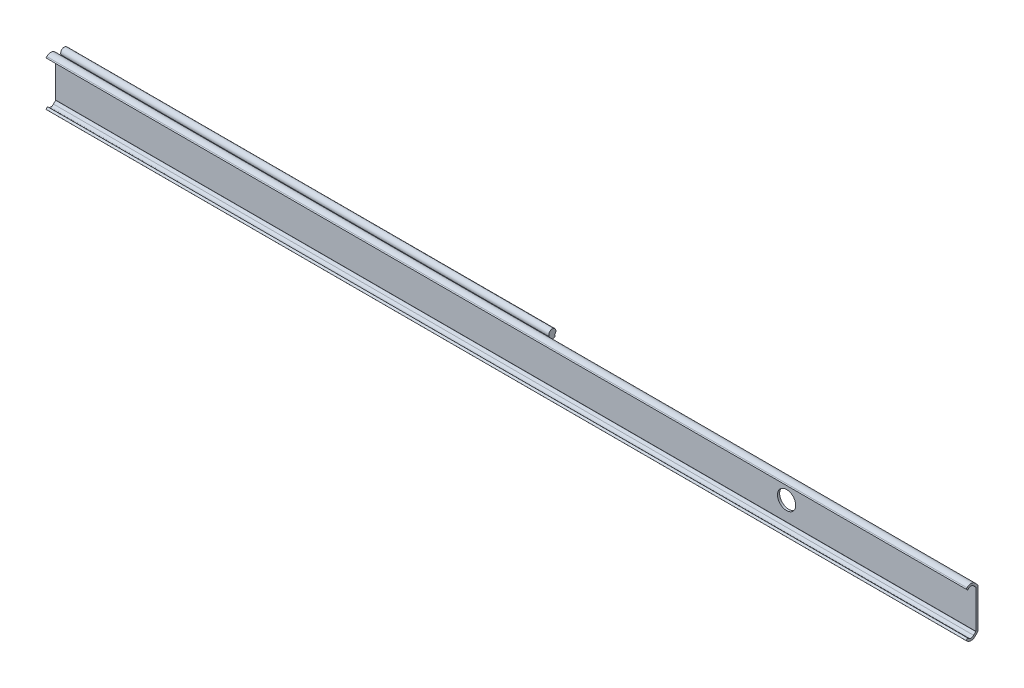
ISO-10303-21;
HEADER;
FILE_DESCRIPTION(('STEP AP214'),'2;1');
FILE_NAME('part.step','',(''),(''),'','','');
FILE_SCHEMA(('AUTOMOTIVE_DESIGN { 1 0 10303 214 1 1 1 1 }'));
ENDSEC;
DATA;
#1=APPLICATION_CONTEXT('core data for automotive mechanical design processes');
#2=APPLICATION_PROTOCOL_DEFINITION('international standard','automotive_design',2000,#1);
#3=PRODUCT_CONTEXT('',#1,'mechanical');
#4=PRODUCT('Part','Part','',(#3));
#5=PRODUCT_RELATED_PRODUCT_CATEGORY('part','',(#4));
#6=PRODUCT_DEFINITION_FORMATION('','',#4);
#7=PRODUCT_DEFINITION_CONTEXT('part definition',#1,'design');
#8=PRODUCT_DEFINITION('design','',#6,#7);
#9=PRODUCT_DEFINITION_SHAPE('','',#8);
#10=(LENGTH_UNIT() NAMED_UNIT(*) SI_UNIT(.MILLI.,.METRE.));
#11=(NAMED_UNIT(*) PLANE_ANGLE_UNIT() SI_UNIT($,.RADIAN.));
#12=(NAMED_UNIT(*) SI_UNIT($,.STERADIAN.) SOLID_ANGLE_UNIT());
#13=UNCERTAINTY_MEASURE_WITH_UNIT(LENGTH_MEASURE(1.E-05),#10,'distance_accuracy_value','');
#14=(GEOMETRIC_REPRESENTATION_CONTEXT(3) GLOBAL_UNCERTAINTY_ASSIGNED_CONTEXT((#13)) GLOBAL_UNIT_ASSIGNED_CONTEXT((#10,
#11,#12)) REPRESENTATION_CONTEXT('',''));
#15=CARTESIAN_POINT('',(0.,0.,0.));
#16=DIRECTION('',(0.,0.,1.));
#17=DIRECTION('',(1.,0.,0.));
#18=AXIS2_PLACEMENT_3D('',#15,#16,#17);
#19=CARTESIAN_POINT('',(0.,-13.561018,0.));
#20=DIRECTION('',(0.,0.,-1.));
#21=DIRECTION('',(1.,0.,0.));
#22=AXIS2_PLACEMENT_3D('',#19,#20,#21);
#23=PLANE('',#22);
#24=CARTESIAN_POINT('',(521.4,0.,0.));
#25=DIRECTION('',(0.,0.,1.));
#26=DIRECTION('',(0.,-1.,0.));
#27=AXIS2_PLACEMENT_3D('',#24,#25,#26);
#28=CIRCLE('',#27,6.5);
#29=CARTESIAN_POINT('',(521.4,-6.5,0.));
#30=VERTEX_POINT('',#29);
#31=EDGE_CURVE('E326',#30,#30,#28,.F.);
#32=ORIENTED_EDGE('',*,*,#31,.F.);
#33=EDGE_LOOP('',(#32));
#34=FACE_BOUND('',#33,.T.);
#35=DIRECTION('',(0.,1.,0.));
#36=VECTOR('',#35,1.);
#37=CARTESIAN_POINT('',(0.,-13.561018,0.));
#38=LINE('',#37,#36);
#39=CARTESIAN_POINT('',(0.,-13.561018,0.));
#40=VERTEX_POINT('',#39);
#41=CARTESIAN_POINT('',(0.,-10.7622239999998,0.));
#42=VERTEX_POINT('',#41);
#43=EDGE_CURVE('E443',#40,#42,#38,.T.);
#44=ORIENTED_EDGE('',*,*,#43,.T.);
#45=DIRECTION('',(1.,0.,0.));
#46=VECTOR('',#45,1.);
#47=CARTESIAN_POINT('',(0.,-10.7622239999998,0.));
#48=LINE('',#47,#46);
#49=CARTESIAN_POINT('',(348.2,-10.7622239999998,0.));
#50=VERTEX_POINT('',#49);
#51=EDGE_CURVE('E9',#42,#50,#48,.T.);
#52=ORIENTED_EDGE('',*,*,#51,.T.);
#53=DIRECTION('',(0.,-1.,0.));
#54=VECTOR('',#53,1.);
#55=CARTESIAN_POINT('',(348.2,10.7622239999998,0.));
#56=LINE('',#55,#54);
#57=CARTESIAN_POINT('',(348.2,10.7622239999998,0.));
#58=VERTEX_POINT('',#57);
#59=EDGE_CURVE('E324',#58,#50,#56,.T.);
#60=ORIENTED_EDGE('',*,*,#59,.F.);
#61=DIRECTION('',(1.,0.,0.));
#62=VECTOR('',#61,1.);
#63=CARTESIAN_POINT('',(0.,10.7622239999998,0.));
#64=LINE('',#63,#62);
#65=CARTESIAN_POINT('',(0.,10.7622239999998,0.));
#66=VERTEX_POINT('',#65);
#67=EDGE_CURVE('E23',#66,#58,#64,.T.);
#68=ORIENTED_EDGE('',*,*,#67,.F.);
#69=CARTESIAN_POINT('',(0.,13.561018,0.));
#70=VERTEX_POINT('',#69);
#71=EDGE_CURVE('E256',#66,#70,#38,.T.);
#72=ORIENTED_EDGE('',*,*,#71,.T.);
#73=DIRECTION('',(1.,0.,0.));
#74=VECTOR('',#73,1.);
#75=CARTESIAN_POINT('',(0.,13.561018,0.));
#76=LINE('',#75,#74);
#77=CARTESIAN_POINT('',(656.4,13.561018,0.));
#78=VERTEX_POINT('',#77);
#79=EDGE_CURVE('E456',#70,#78,#76,.T.);
#80=ORIENTED_EDGE('',*,*,#79,.T.);
#81=DIRECTION('',(0.,1.,0.));
#82=VECTOR('',#81,1.);
#83=CARTESIAN_POINT('',(656.4,-13.561018,0.));
#84=LINE('',#83,#82);
#85=CARTESIAN_POINT('',(656.4,-13.561018,0.));
#86=VERTEX_POINT('',#85);
#87=EDGE_CURVE('E384',#86,#78,#84,.T.);
#88=ORIENTED_EDGE('',*,*,#87,.F.);
#89=DIRECTION('',(1.,0.,0.));
#90=VECTOR('',#89,1.);
#91=CARTESIAN_POINT('',(0.,-13.561018,0.));
#92=LINE('',#91,#90);
#93=EDGE_CURVE('E459',#40,#86,#92,.T.);
#94=ORIENTED_EDGE('',*,*,#93,.F.);
#95=EDGE_LOOP('',(#44,#52,#60,#68,#72,#80,#88,#94));
#96=FACE_BOUND('',#95,.T.);
#97=ADVANCED_FACE('F14',(#34,#96),#23,.T.);
#98=CARTESIAN_POINT('',(0.,-11.8784795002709,-5.98462837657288));
#99=DIRECTION('',(0.,-0.60181512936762,-0.798635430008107));
#100=DIRECTION('',(0.,0.798635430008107,-0.60181512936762));
#101=AXIS2_PLACEMENT_3D('',#98,#99,#100);
#102=PLANE('',#101);
#103=DIRECTION('',(0.,0.798635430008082,-0.601815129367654));
#104=VECTOR('',#103,1.);
#105=CARTESIAN_POINT('',(348.2,-11.8784795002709,-5.98462837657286));
#106=LINE('',#105,#104);
#107=CARTESIAN_POINT('',(348.2,-11.6159967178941,-6.18242339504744));
#108=VERTEX_POINT('',#107);
#109=CARTESIAN_POINT('',(348.2,-11.0618539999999,-6.6));
#110=VERTEX_POINT('',#109);
#111=EDGE_CURVE('E304',#108,#110,#106,.T.);
#112=ORIENTED_EDGE('',*,*,#111,.F.);
#113=DIRECTION('',(1.,0.,0.));
#114=VECTOR('',#113,1.);
#115=CARTESIAN_POINT('',(0.,-11.6159967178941,-6.18242339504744));
#116=LINE('',#115,#114);
#117=CARTESIAN_POINT('',(0.,-11.6159967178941,-6.18242339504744));
#118=VERTEX_POINT('',#117);
#119=EDGE_CURVE('E299',#118,#108,#116,.T.);
#120=ORIENTED_EDGE('',*,*,#119,.F.);
#121=DIRECTION('',(0.,0.798635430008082,-0.601815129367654));
#122=VECTOR('',#121,1.);
#123=CARTESIAN_POINT('',(0.,-11.6159967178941,-6.18242339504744));
#124=LINE('',#123,#122);
#125=CARTESIAN_POINT('',(0.,-11.0618539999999,-6.6));
#126=VERTEX_POINT('',#125);
#127=EDGE_CURVE('E271',#118,#126,#124,.T.);
#128=ORIENTED_EDGE('',*,*,#127,.T.);
#129=DIRECTION('',(1.,0.,0.));
#130=VECTOR('',#129,1.);
#131=CARTESIAN_POINT('',(0.,-11.0618539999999,-6.6));
#132=LINE('',#131,#130);
#133=EDGE_CURVE('E18',#126,#110,#132,.T.);
#134=ORIENTED_EDGE('',*,*,#133,.T.);
#135=EDGE_LOOP('',(#112,#120,#128,#134));
#136=FACE_BOUND('',#135,.T.);
#137=ADVANCED_FACE('F16',(#136),#102,.T.);
#138=CARTESIAN_POINT('',(0.,-11.0618539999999,-6.6));
#139=DIRECTION('',(0.,0.,-1.));
#140=DIRECTION('',(1.,0.,0.));
#141=AXIS2_PLACEMENT_3D('',#138,#139,#140);
#142=PLANE('',#141);
#143=DIRECTION('',(1.,0.,0.));
#144=VECTOR('',#143,1.);
#145=CARTESIAN_POINT('',(0.,-10.4239399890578,-6.6));
#146=LINE('',#145,#144);
#147=CARTESIAN_POINT('',(0.,-10.4239399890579,-6.6));
#148=VERTEX_POINT('',#147);
#149=CARTESIAN_POINT('',(348.2,-10.4239399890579,-6.6));
#150=VERTEX_POINT('',#149);
#151=EDGE_CURVE('E509',#148,#150,#146,.T.);
#152=ORIENTED_EDGE('',*,*,#151,.T.);
#153=DIRECTION('',(0.,1.,0.));
#154=VECTOR('',#153,1.);
#155=CARTESIAN_POINT('',(348.2,-11.0618539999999,-6.6));
#156=LINE('',#155,#154);
#157=EDGE_CURVE('E306',#110,#150,#156,.T.);
#158=ORIENTED_EDGE('',*,*,#157,.F.);
#159=ORIENTED_EDGE('',*,*,#133,.F.);
#160=DIRECTION('',(0.,1.,0.));
#161=VECTOR('',#160,1.);
#162=CARTESIAN_POINT('',(0.,-11.0618539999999,-6.6));
#163=LINE('',#162,#161);
#164=EDGE_CURVE('E274',#126,#148,#163,.T.);
#165=ORIENTED_EDGE('',*,*,#164,.T.);
#166=EDGE_LOOP('',(#152,#158,#159,#165));
#167=FACE_BOUND('',#166,.T.);
#168=ADVANCED_FACE('F518',(#167),#142,.T.);
#169=CARTESIAN_POINT('',(0.,-13.915,-4.44999999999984));
#170=DIRECTION('',(1.,0.,0.));
#171=DIRECTION('',(0.,0.,1.));
#172=AXIS2_PLACEMENT_3D('',#169,#170,#171);
#173=CYLINDRICAL_SURFACE('',#172,4.1);
#174=DIRECTION('',(1.,0.,0.));
#175=VECTOR('',#174,1.);
#176=CARTESIAN_POINT('',(0.,-10.8444026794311,-1.73312089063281));
#177=LINE('',#176,#175);
#178=CARTESIAN_POINT('',(0.,-10.8444026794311,-1.73312089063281));
#179=VERTEX_POINT('',#178);
#180=CARTESIAN_POINT('',(348.2,-10.8444026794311,-1.73312089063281));
#181=VERTEX_POINT('',#180);
#182=EDGE_CURVE('E507',#179,#181,#177,.T.);
#183=ORIENTED_EDGE('',*,*,#182,.T.);
#184=CARTESIAN_POINT('',(348.2,-13.915,-4.44999999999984));
#185=DIRECTION('',(1.,0.,0.));
#186=DIRECTION('',(0.,0.,1.));
#187=AXIS2_PLACEMENT_3D('',#184,#185,#186);
#188=CIRCLE('',#187,4.1);
#189=EDGE_CURVE('E308',#150,#181,#188,.T.);
#190=ORIENTED_EDGE('',*,*,#189,.F.);
#191=ORIENTED_EDGE('',*,*,#151,.F.);
#192=CARTESIAN_POINT('',(0.,-13.915,-4.44999999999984));
#193=DIRECTION('',(1.,0.,0.));
#194=DIRECTION('',(0.,0.,1.));
#195=AXIS2_PLACEMENT_3D('',#192,#193,#194);
#196=CIRCLE('',#195,4.1);
#197=EDGE_CURVE('E277',#148,#179,#196,.T.);
#198=ORIENTED_EDGE('',*,*,#197,.T.);
#199=EDGE_LOOP('',(#183,#190,#191,#198));
#200=FACE_BOUND('',#199,.T.);
#201=ADVANCED_FACE('F524',(#200),#173,.T.);
#202=CARTESIAN_POINT('',(0.,-10.7622239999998,-1.66));
#203=DIRECTION('',(1.,0.,0.));
#204=DIRECTION('',(0.,0.,1.));
#205=AXIS2_PLACEMENT_3D('',#202,#203,#204);
#206=CYLINDRICAL_SURFACE('',#205,0.110000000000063);
#207=DIRECTION('',(1.,0.,0.));
#208=VECTOR('',#207,1.);
#209=CARTESIAN_POINT('',(0.,-10.7622239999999,-1.54999999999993));
#210=LINE('',#209,#208);
#211=CARTESIAN_POINT('',(0.,-10.7622239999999,-1.54999999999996));
#212=VERTEX_POINT('',#211);
#213=CARTESIAN_POINT('',(348.2,-10.7622239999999,-1.54999999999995));
#214=VERTEX_POINT('',#213);
#215=EDGE_CURVE('E504',#212,#214,#210,.T.);
#216=ORIENTED_EDGE('',*,*,#215,.T.);
#217=CARTESIAN_POINT('',(348.2,-10.7622239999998,-1.66));
#218=DIRECTION('',(-1.,0.,0.));
#219=DIRECTION('',(0.,0.,1.));
#220=AXIS2_PLACEMENT_3D('',#217,#218,#219);
#221=CIRCLE('',#220,0.110000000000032);
#222=EDGE_CURVE('E310',#181,#214,#221,.T.);
#223=ORIENTED_EDGE('',*,*,#222,.F.);
#224=ORIENTED_EDGE('',*,*,#182,.F.);
#225=CARTESIAN_POINT('',(0.,-10.7622239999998,-1.66));
#226=DIRECTION('',(-1.,0.,0.));
#227=DIRECTION('',(0.,0.,1.));
#228=AXIS2_PLACEMENT_3D('',#225,#226,#227);
#229=CIRCLE('',#228,0.110000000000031);
#230=EDGE_CURVE('E280',#179,#212,#229,.T.);
#231=ORIENTED_EDGE('',*,*,#230,.T.);
#232=EDGE_LOOP('',(#216,#223,#224,#231));
#233=FACE_BOUND('',#232,.T.);
#234=ADVANCED_FACE('F531',(#233),#206,.F.);
#235=CARTESIAN_POINT('',(0.,10.7622239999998,-1.66));
#236=DIRECTION('',(1.,0.,0.));
#237=DIRECTION('',(0.,0.,1.));
#238=AXIS2_PLACEMENT_3D('',#235,#236,#237);
#239=CYLINDRICAL_SURFACE('',#238,0.110000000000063);
#240=DIRECTION('',(1.,0.,0.));
#241=VECTOR('',#240,1.);
#242=CARTESIAN_POINT('',(0.,10.8444026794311,-1.73312089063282));
#243=LINE('',#242,#241);
#244=CARTESIAN_POINT('',(0.,10.8444026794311,-1.73312089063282));
#245=VERTEX_POINT('',#244);
#246=CARTESIAN_POINT('',(348.2,10.8444026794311,-1.73312089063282));
#247=VERTEX_POINT('',#246);
#248=EDGE_CURVE('E498',#245,#247,#243,.T.);
#249=ORIENTED_EDGE('',*,*,#248,.T.);
#250=CARTESIAN_POINT('',(348.2,10.7622239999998,-1.66));
#251=DIRECTION('',(-1.,0.,0.));
#252=DIRECTION('',(0.,0.,1.));
#253=AXIS2_PLACEMENT_3D('',#250,#251,#252);
#254=CIRCLE('',#253,0.110000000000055);
#255=CARTESIAN_POINT('',(348.2,10.7622239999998,-1.54999999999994));
#256=VERTEX_POINT('',#255);
#257=EDGE_CURVE('E314',#256,#247,#254,.T.);
#258=ORIENTED_EDGE('',*,*,#257,.F.);
#259=DIRECTION('',(1.,0.,0.));
#260=VECTOR('',#259,1.);
#261=CARTESIAN_POINT('',(0.,10.7622239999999,-1.54999999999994));
#262=LINE('',#261,#260);
#263=CARTESIAN_POINT('',(0.,10.7622239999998,-1.54999999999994));
#264=VERTEX_POINT('',#263);
#265=EDGE_CURVE('E501',#264,#256,#262,.T.);
#266=ORIENTED_EDGE('',*,*,#265,.F.);
#267=CARTESIAN_POINT('',(0.,10.7622239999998,-1.66));
#268=DIRECTION('',(-1.,0.,0.));
#269=DIRECTION('',(0.,0.,1.));
#270=AXIS2_PLACEMENT_3D('',#267,#268,#269);
#271=CIRCLE('',#270,0.110000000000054);
#272=EDGE_CURVE('E286',#264,#245,#271,.T.);
#273=ORIENTED_EDGE('',*,*,#272,.T.);
#274=EDGE_LOOP('',(#249,#258,#266,#273));
#275=FACE_BOUND('',#274,.T.);
#276=ADVANCED_FACE('F538',(#275),#239,.F.);
#277=CARTESIAN_POINT('',(0.,13.915,-4.44999999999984));
#278=DIRECTION('',(1.,0.,0.));
#279=DIRECTION('',(0.,0.,1.));
#280=AXIS2_PLACEMENT_3D('',#277,#278,#279);
#281=CYLINDRICAL_SURFACE('',#280,4.1);
#282=DIRECTION('',(1.,0.,0.));
#283=VECTOR('',#282,1.);
#284=CARTESIAN_POINT('',(0.,10.4239399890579,-6.59999999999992));
#285=LINE('',#284,#283);
#286=CARTESIAN_POINT('',(0.,10.4239399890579,-6.59999999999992));
#287=VERTEX_POINT('',#286);
#288=CARTESIAN_POINT('',(348.2,10.4239399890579,-6.59999999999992));
#289=VERTEX_POINT('',#288);
#290=EDGE_CURVE('E495',#287,#289,#285,.T.);
#291=ORIENTED_EDGE('',*,*,#290,.T.);
#292=CARTESIAN_POINT('',(348.2,13.915,-4.44999999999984));
#293=DIRECTION('',(1.,0.,0.));
#294=DIRECTION('',(0.,0.,1.));
#295=AXIS2_PLACEMENT_3D('',#292,#293,#294);
#296=CIRCLE('',#295,4.09999999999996);
#297=EDGE_CURVE('E316',#247,#289,#296,.T.);
#298=ORIENTED_EDGE('',*,*,#297,.F.);
#299=ORIENTED_EDGE('',*,*,#248,.F.);
#300=CARTESIAN_POINT('',(0.,13.915,-4.44999999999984));
#301=DIRECTION('',(1.,0.,0.));
#302=DIRECTION('',(0.,0.,1.));
#303=AXIS2_PLACEMENT_3D('',#300,#301,#302);
#304=CIRCLE('',#303,4.1);
#305=EDGE_CURVE('E289',#245,#287,#304,.T.);
#306=ORIENTED_EDGE('',*,*,#305,.T.);
#307=EDGE_LOOP('',(#291,#298,#299,#306));
#308=FACE_BOUND('',#307,.T.);
#309=ADVANCED_FACE('F543',(#308),#281,.T.);
#310=CARTESIAN_POINT('',(0.,11.0618539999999,-6.6));
#311=DIRECTION('',(0.,0.,-1.));
#312=DIRECTION('',(1.,0.,0.));
#313=AXIS2_PLACEMENT_3D('',#310,#311,#312);
#314=PLANE('',#313);
#315=DIRECTION('',(1.,0.,0.));
#316=VECTOR('',#315,1.);
#317=CARTESIAN_POINT('',(0.,11.0618539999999,-6.6));
#318=LINE('',#317,#316);
#319=CARTESIAN_POINT('',(0.,11.0618539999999,-6.6));
#320=VERTEX_POINT('',#319);
#321=CARTESIAN_POINT('',(348.2,11.0618539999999,-6.6));
#322=VERTEX_POINT('',#321);
#323=EDGE_CURVE('E336',#320,#322,#318,.T.);
#324=ORIENTED_EDGE('',*,*,#323,.T.);
#325=DIRECTION('',(0.,1.,-1.2645065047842E-13));
#326=VECTOR('',#325,1.);
#327=CARTESIAN_POINT('',(348.2,10.4239399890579,-6.59999999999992));
#328=LINE('',#327,#326);
#329=EDGE_CURVE('E318',#289,#322,#328,.T.);
#330=ORIENTED_EDGE('',*,*,#329,.F.);
#331=ORIENTED_EDGE('',*,*,#290,.F.);
#332=DIRECTION('',(0.,1.,-1.2645065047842E-13));
#333=VECTOR('',#332,1.);
#334=CARTESIAN_POINT('',(0.,10.4239399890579,-6.59999999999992));
#335=LINE('',#334,#333);
#336=EDGE_CURVE('E292',#287,#320,#335,.T.);
#337=ORIENTED_EDGE('',*,*,#336,.T.);
#338=EDGE_LOOP('',(#324,#330,#331,#337));
#339=FACE_BOUND('',#338,.T.);
#340=ADVANCED_FACE('F545',(#339),#314,.T.);
#341=CARTESIAN_POINT('',(0.,11.8784795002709,-5.98462837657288));
#342=DIRECTION('',(0.,0.60181512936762,-0.798635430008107));
#343=DIRECTION('',(0.,0.798635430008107,0.60181512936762));
#344=AXIS2_PLACEMENT_3D('',#341,#342,#343);
#345=PLANE('',#344);
#346=DIRECTION('',(1.,0.,0.));
#347=VECTOR('',#346,1.);
#348=CARTESIAN_POINT('',(0.,11.6159967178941,-6.18242339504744));
#349=LINE('',#348,#347);
#350=CARTESIAN_POINT('',(0.,11.6159967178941,-6.18242339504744));
#351=VERTEX_POINT('',#350);
#352=CARTESIAN_POINT('',(348.2,11.6159967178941,-6.18242339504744));
#353=VERTEX_POINT('',#352);
#354=EDGE_CURVE('E260',#351,#353,#349,.T.);
#355=ORIENTED_EDGE('',*,*,#354,.T.);
#356=DIRECTION('',(0.,0.798635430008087,0.601815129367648));
#357=VECTOR('',#356,1.);
#358=CARTESIAN_POINT('',(348.2,11.0618539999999,-6.6));
#359=LINE('',#358,#357);
#360=EDGE_CURVE('E320',#322,#353,#359,.T.);
#361=ORIENTED_EDGE('',*,*,#360,.F.);
#362=ORIENTED_EDGE('',*,*,#323,.F.);
#363=DIRECTION('',(0.,0.798635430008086,0.601815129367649));
#364=VECTOR('',#363,1.);
#365=CARTESIAN_POINT('',(0.,11.0618539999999,-6.6));
#366=LINE('',#365,#364);
#367=EDGE_CURVE('E247',#320,#351,#366,.T.);
#368=ORIENTED_EDGE('',*,*,#367,.T.);
#369=EDGE_LOOP('',(#355,#361,#362,#368));
#370=FACE_BOUND('',#369,.T.);
#371=ADVANCED_FACE('F547',(#370),#345,.T.);
#372=CARTESIAN_POINT('',(0.,10.7622239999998,-1.66));
#373=DIRECTION('',(1.,0.,0.));
#374=DIRECTION('',(0.,0.,1.));
#375=AXIS2_PLACEMENT_3D('',#372,#373,#374);
#376=CYLINDRICAL_SURFACE('',#375,1.66);
#377=CARTESIAN_POINT('',(348.2,10.7622239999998,-1.66));
#378=DIRECTION('',(1.,0.,0.));
#379=DIRECTION('',(0.,0.,1.));
#380=AXIS2_PLACEMENT_3D('',#377,#378,#379);
#381=CIRCLE('',#380,1.65999999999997);
#382=CARTESIAN_POINT('',(348.2,12.2669175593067,-2.36106867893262));
#383=VERTEX_POINT('',#382);
#384=EDGE_CURVE('E241',#383,#58,#381,.T.);
#385=ORIENTED_EDGE('',*,*,#384,.F.);
#386=DIRECTION('',(1.,0.,0.));
#387=VECTOR('',#386,1.);
#388=CARTESIAN_POINT('',(0.,12.2669175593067,-2.36106867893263));
#389=LINE('',#388,#387);
#390=CARTESIAN_POINT('',(0.,12.2669175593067,-2.36106867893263));
#391=VERTEX_POINT('',#390);
#392=EDGE_CURVE('E237',#391,#383,#389,.T.);
#393=ORIENTED_EDGE('',*,*,#392,.F.);
#394=CARTESIAN_POINT('',(0.,10.7622239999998,-1.66));
#395=DIRECTION('',(1.,0.,0.));
#396=DIRECTION('',(0.,0.,1.));
#397=AXIS2_PLACEMENT_3D('',#394,#395,#396);
#398=CIRCLE('',#397,1.65999999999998);
#399=EDGE_CURVE('E240',#391,#66,#398,.T.);
#400=ORIENTED_EDGE('',*,*,#399,.T.);
#401=ORIENTED_EDGE('',*,*,#67,.T.);
#402=EDGE_LOOP('',(#385,#393,#400,#401));
#403=FACE_BOUND('',#402,.T.);
#404=ADVANCED_FACE('F239',(#403),#376,.T.);
#405=CARTESIAN_POINT('',(0.,-10.7622239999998,-1.66));
#406=DIRECTION('',(1.,0.,0.));
#407=DIRECTION('',(0.,0.,1.));
#408=AXIS2_PLACEMENT_3D('',#405,#406,#407);
#409=CYLINDRICAL_SURFACE('',#408,1.66);
#410=DIRECTION('',(1.,0.,0.));
#411=VECTOR('',#410,1.);
#412=CARTESIAN_POINT('',(0.,-12.2669175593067,-2.36106867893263));
#413=LINE('',#412,#411);
#414=CARTESIAN_POINT('',(0.,-12.2669175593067,-2.36106867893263));
#415=VERTEX_POINT('',#414);
#416=CARTESIAN_POINT('',(348.2,-12.2669175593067,-2.36106867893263));
#417=VERTEX_POINT('',#416);
#418=EDGE_CURVE('E246',#415,#417,#413,.T.);
#419=ORIENTED_EDGE('',*,*,#418,.T.);
#420=CARTESIAN_POINT('',(348.2,-10.7622239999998,-1.66));
#421=DIRECTION('',(1.,0.,0.));
#422=DIRECTION('',(0.,0.,1.));
#423=AXIS2_PLACEMENT_3D('',#420,#421,#422);
#424=CIRCLE('',#423,1.66);
#425=EDGE_CURVE('E298',#50,#417,#424,.T.);
#426=ORIENTED_EDGE('',*,*,#425,.F.);
#427=ORIENTED_EDGE('',*,*,#51,.F.);
#428=CARTESIAN_POINT('',(0.,-10.7622239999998,-1.66));
#429=DIRECTION('',(1.,0.,0.));
#430=DIRECTION('',(0.,0.,1.));
#431=AXIS2_PLACEMENT_3D('',#428,#429,#430);
#432=CIRCLE('',#431,1.65999999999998);
#433=EDGE_CURVE('E257',#42,#415,#432,.T.);
#434=ORIENTED_EDGE('',*,*,#433,.T.);
#435=EDGE_LOOP('',(#419,#426,#427,#434));
#436=FACE_BOUND('',#435,.T.);
#437=ADVANCED_FACE('F553',(#436),#409,.T.);
#438=CARTESIAN_POINT('',(0.,-10.7622239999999,-1.54999999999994));
#439=DIRECTION('',(0.,0.,-1.));
#440=DIRECTION('',(1.,0.,0.));
#441=AXIS2_PLACEMENT_3D('',#438,#439,#440);
#442=PLANE('',#441);
#443=ORIENTED_EDGE('',*,*,#265,.T.);
#444=DIRECTION('',(0.,1.,0.));
#445=VECTOR('',#444,1.);
#446=CARTESIAN_POINT('',(348.2,-10.7622239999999,-1.54999999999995));
#447=LINE('',#446,#445);
#448=EDGE_CURVE('E312',#214,#256,#447,.T.);
#449=ORIENTED_EDGE('',*,*,#448,.F.);
#450=ORIENTED_EDGE('',*,*,#215,.F.);
#451=DIRECTION('',(0.,1.,0.));
#452=VECTOR('',#451,1.);
#453=CARTESIAN_POINT('',(0.,-10.7622239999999,-1.54999999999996));
#454=LINE('',#453,#452);
#455=EDGE_CURVE('E283',#212,#264,#454,.T.);
#456=ORIENTED_EDGE('',*,*,#455,.T.);
#457=EDGE_LOOP('',(#443,#449,#450,#456));
#458=FACE_BOUND('',#457,.T.);
#459=ADVANCED_FACE('F533',(#458),#442,.T.);
#460=CARTESIAN_POINT('',(0.,14.8073560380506,0.501292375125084));
#461=DIRECTION('',(0.,0.692409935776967,-0.721504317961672));
#462=DIRECTION('',(0.,0.721504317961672,0.692409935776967));
#463=AXIS2_PLACEMENT_3D('',#460,#461,#462);
#464=PLANE('',#463);
#465=DIRECTION('',(0.,0.721504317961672,0.692409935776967));
#466=VECTOR('',#465,1.);
#467=CARTESIAN_POINT('',(656.4,14.8073560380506,0.501292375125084));
#468=LINE('',#467,#466);
#469=CARTESIAN_POINT('',(656.4,14.8073560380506,0.501292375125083));
#470=VERTEX_POINT('',#469);
#471=CARTESIAN_POINT('',(656.4,16.4741282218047,2.10085261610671));
#472=VERTEX_POINT('',#471);
#473=EDGE_CURVE('E389',#470,#472,#468,.T.);
#474=ORIENTED_EDGE('',*,*,#473,.F.);
#475=DIRECTION('',(1.,0.,0.));
#476=VECTOR('',#475,1.);
#477=CARTESIAN_POINT('',(0.,14.8073560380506,0.501292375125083));
#478=LINE('',#477,#476);
#479=CARTESIAN_POINT('',(0.,14.8073560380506,0.501292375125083));
#480=VERTEX_POINT('',#479);
#481=EDGE_CURVE('E454',#480,#470,#478,.T.);
#482=ORIENTED_EDGE('',*,*,#481,.F.);
#483=DIRECTION('',(0.,0.721504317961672,0.692409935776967));
#484=VECTOR('',#483,1.);
#485=CARTESIAN_POINT('',(0.,14.8073560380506,0.501292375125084));
#486=LINE('',#485,#484);
#487=CARTESIAN_POINT('',(0.,16.4741282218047,2.10085261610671));
#488=VERTEX_POINT('',#487);
#489=EDGE_CURVE('E448',#480,#488,#486,.T.);
#490=ORIENTED_EDGE('',*,*,#489,.T.);
#491=DIRECTION('',(1.,0.,0.));
#492=VECTOR('',#491,1.);
#493=CARTESIAN_POINT('',(0.,16.4741282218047,2.10085261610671));
#494=LINE('',#493,#492);
#495=EDGE_CURVE('E452',#488,#472,#494,.T.);
#496=ORIENTED_EDGE('',*,*,#495,.T.);
#497=EDGE_LOOP('',(#474,#482,#490,#496));
#498=FACE_BOUND('',#497,.T.);
#499=ADVANCED_FACE('F645',(#498),#464,.T.);
#500=CARTESIAN_POINT('',(0.,13.5750000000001,5.00000000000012));
#501=DIRECTION('',(1.,0.,0.));
#502=DIRECTION('',(0.,0.,1.));
#503=AXIS2_PLACEMENT_3D('',#500,#501,#502);
#504=CYLINDRICAL_SURFACE('',#503,4.1);
#505=CARTESIAN_POINT('',(656.4,13.5750000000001,5.00000000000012));
#506=DIRECTION('',(1.,0.,0.));
#507=DIRECTION('',(0.,0.,-1.));
#508=AXIS2_PLACEMENT_3D('',#505,#506,#507);
#509=CIRCLE('',#508,4.1);
#510=CARTESIAN_POINT('',(656.4,16.4741282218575,7.89914738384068));
#511=VERTEX_POINT('',#510);
#512=EDGE_CURVE('E332',#472,#511,#509,.T.);
#513=ORIENTED_EDGE('',*,*,#512,.F.);
#514=ORIENTED_EDGE('',*,*,#495,.F.);
#515=CARTESIAN_POINT('',(0.,13.5750000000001,5.00000000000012));
#516=DIRECTION('',(1.,0.,0.));
#517=DIRECTION('',(0.,0.,-1.));
#518=AXIS2_PLACEMENT_3D('',#515,#516,#517);
#519=CIRCLE('',#518,4.1);
#520=CARTESIAN_POINT('',(0.,16.4741282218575,7.89914738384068));
#521=VERTEX_POINT('',#520);
#522=EDGE_CURVE('E392',#488,#521,#519,.T.);
#523=ORIENTED_EDGE('',*,*,#522,.T.);
#524=DIRECTION('',(1.,0.,0.));
#525=VECTOR('',#524,1.);
#526=CARTESIAN_POINT('',(0.,16.4741282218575,7.89914738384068));
#527=LINE('',#526,#525);
#528=EDGE_CURVE('E451',#521,#511,#527,.T.);
#529=ORIENTED_EDGE('',*,*,#528,.T.);
#530=EDGE_LOOP('',(#513,#514,#523,#529));
#531=FACE_BOUND('',#530,.T.);
#532=ADVANCED_FACE('F641',(#531),#504,.T.);
#533=CARTESIAN_POINT('',(0.,15.8897090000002,8.45999999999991));
#534=DIRECTION('',(0.,0.692409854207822,0.721504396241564));
#535=DIRECTION('',(0.,-0.721504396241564,0.692409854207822));
#536=AXIS2_PLACEMENT_3D('',#533,#534,#535);
#537=PLANE('',#536);
#538=DIRECTION('',(0.,-0.721504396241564,0.692409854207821));
#539=VECTOR('',#538,1.);
#540=CARTESIAN_POINT('',(656.4,15.8897090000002,8.45999999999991));
#541=LINE('',#540,#539);
#542=CARTESIAN_POINT('',(656.4,15.8897090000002,8.45999999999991));
#543=VERTEX_POINT('',#542);
#544=EDGE_CURVE('E335',#511,#543,#541,.T.);
#545=ORIENTED_EDGE('',*,*,#544,.F.);
#546=ORIENTED_EDGE('',*,*,#528,.F.);
#547=DIRECTION('',(0.,-0.721504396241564,0.692409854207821));
#548=VECTOR('',#547,1.);
#549=CARTESIAN_POINT('',(0.,15.8897090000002,8.45999999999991));
#550=LINE('',#549,#548);
#551=CARTESIAN_POINT('',(0.,15.8897090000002,8.45999999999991));
#552=VERTEX_POINT('',#551);
#553=EDGE_CURVE('E395',#521,#552,#550,.T.);
#554=ORIENTED_EDGE('',*,*,#553,.T.);
#555=DIRECTION('',(1.,0.,0.));
#556=VECTOR('',#555,1.);
#557=CARTESIAN_POINT('',(0.,15.8897090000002,8.45999999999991));
#558=LINE('',#557,#556);
#559=EDGE_CURVE('E489',#552,#543,#558,.T.);
#560=ORIENTED_EDGE('',*,*,#559,.T.);
#561=EDGE_LOOP('',(#545,#546,#554,#560));
#562=FACE_BOUND('',#561,.T.);
#563=ADVANCED_FACE('F637',(#562),#537,.T.);
#564=CARTESIAN_POINT('',(0.,14.7934620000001,7.363752));
#565=DIRECTION('',(0.,-0.707107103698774,0.707106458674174));
#566=DIRECTION('',(0.,-0.707106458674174,-0.707107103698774));
#567=AXIS2_PLACEMENT_3D('',#564,#565,#566);
#568=PLANE('',#567);
#569=DIRECTION('',(0.,-0.707106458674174,-0.707107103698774));
#570=VECTOR('',#569,1.);
#571=CARTESIAN_POINT('',(656.4,14.7934620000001,7.363752));
#572=LINE('',#571,#570);
#573=CARTESIAN_POINT('',(656.4,14.7934620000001,7.363752));
#574=VERTEX_POINT('',#573);
#575=EDGE_CURVE('E339',#543,#574,#572,.T.);
#576=ORIENTED_EDGE('',*,*,#575,.F.);
#577=ORIENTED_EDGE('',*,*,#559,.F.);
#578=DIRECTION('',(0.,-0.707106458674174,-0.707107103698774));
#579=VECTOR('',#578,1.);
#580=CARTESIAN_POINT('',(0.,14.7934620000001,7.363752));
#581=LINE('',#580,#579);
#582=CARTESIAN_POINT('',(0.,14.7934620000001,7.363752));
#583=VERTEX_POINT('',#582);
#584=EDGE_CURVE('E398',#552,#583,#581,.T.);
#585=ORIENTED_EDGE('',*,*,#584,.T.);
#586=DIRECTION('',(1.,0.,0.));
#587=VECTOR('',#586,1.);
#588=CARTESIAN_POINT('',(0.,14.7934620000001,7.363752));
#589=LINE('',#588,#587);
#590=EDGE_CURVE('E487',#583,#574,#589,.T.);
#591=ORIENTED_EDGE('',*,*,#590,.T.);
#592=EDGE_LOOP('',(#576,#577,#585,#591));
#593=FACE_BOUND('',#592,.T.);
#594=ADVANCED_FACE('F633',(#593),#568,.T.);
#595=CARTESIAN_POINT('',(0.,15.3880487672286,6.79314086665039));
#596=DIRECTION('',(0.,-0.692410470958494,-0.721503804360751));
#597=DIRECTION('',(0.,0.721503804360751,-0.692410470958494));
#598=AXIS2_PLACEMENT_3D('',#595,#596,#597);
#599=PLANE('',#598);
#600=DIRECTION('',(0.,0.721503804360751,-0.692410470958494));
#601=VECTOR('',#600,1.);
#602=CARTESIAN_POINT('',(656.4,15.3880487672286,6.79314086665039));
#603=LINE('',#602,#601);
#604=CARTESIAN_POINT('',(656.4,15.3880487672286,6.79314086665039));
#605=VERTEX_POINT('',#604);
#606=EDGE_CURVE('E342',#574,#605,#603,.T.);
#607=ORIENTED_EDGE('',*,*,#606,.F.);
#608=ORIENTED_EDGE('',*,*,#590,.F.);
#609=DIRECTION('',(0.,0.721503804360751,-0.692410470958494));
#610=VECTOR('',#609,1.);
#611=CARTESIAN_POINT('',(0.,15.3880487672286,6.79314086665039));
#612=LINE('',#611,#610);
#613=CARTESIAN_POINT('',(0.,15.3880487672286,6.79314086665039));
#614=VERTEX_POINT('',#613);
#615=EDGE_CURVE('E401',#583,#614,#612,.T.);
#616=ORIENTED_EDGE('',*,*,#615,.T.);
#617=DIRECTION('',(1.,0.,0.));
#618=VECTOR('',#617,1.);
#619=CARTESIAN_POINT('',(0.,15.3880487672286,6.79314086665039));
#620=LINE('',#619,#618);
#621=EDGE_CURVE('E485',#614,#605,#620,.T.);
#622=ORIENTED_EDGE('',*,*,#621,.T.);
#623=EDGE_LOOP('',(#607,#608,#616,#622));
#624=FACE_BOUND('',#623,.T.);
#625=ADVANCED_FACE('F629',(#624),#599,.T.);
#626=CARTESIAN_POINT('',(0.,13.5750000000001,5.00000000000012));
#627=DIRECTION('',(1.,0.,0.));
#628=DIRECTION('',(0.,0.,1.));
#629=AXIS2_PLACEMENT_3D('',#626,#627,#628);
#630=CYLINDRICAL_SURFACE('',#629,2.55);
#631=CARTESIAN_POINT('',(656.4,13.5750000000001,5.00000000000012));
#632=DIRECTION('',(-1.,0.,0.));
#633=DIRECTION('',(0.,0.,1.));
#634=AXIS2_PLACEMENT_3D('',#631,#632,#633);
#635=CIRCLE('',#634,2.55);
#636=CARTESIAN_POINT('',(656.4,15.2920682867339,3.11474762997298));
#637=VERTEX_POINT('',#636);
#638=EDGE_CURVE('E345',#605,#637,#635,.T.);
#639=ORIENTED_EDGE('',*,*,#638,.F.);
#640=ORIENTED_EDGE('',*,*,#621,.F.);
#641=CARTESIAN_POINT('',(0.,13.5750000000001,5.00000000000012));
#642=DIRECTION('',(-1.,0.,0.));
#643=DIRECTION('',(0.,0.,1.));
#644=AXIS2_PLACEMENT_3D('',#641,#642,#643);
#645=CIRCLE('',#644,2.55);
#646=CARTESIAN_POINT('',(0.,15.2920682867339,3.11474762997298));
#647=VERTEX_POINT('',#646);
#648=EDGE_CURVE('E404',#614,#647,#645,.T.);
#649=ORIENTED_EDGE('',*,*,#648,.T.);
#650=DIRECTION('',(1.,0.,0.));
#651=VECTOR('',#650,1.);
#652=CARTESIAN_POINT('',(0.,15.2920682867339,3.11474762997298));
#653=LINE('',#652,#651);
#654=EDGE_CURVE('E483',#647,#637,#653,.T.);
#655=ORIENTED_EDGE('',*,*,#654,.T.);
#656=EDGE_LOOP('',(#639,#640,#649,#655));
#657=FACE_BOUND('',#656,.T.);
#658=ADVANCED_FACE('F625',(#657),#630,.F.);
#659=CARTESIAN_POINT('',(0.,13.7341205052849,1.61962394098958));
#660=DIRECTION('',(0.,-0.692409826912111,0.721504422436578));
#661=DIRECTION('',(0.,-0.721504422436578,-0.692409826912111));
#662=AXIS2_PLACEMENT_3D('',#659,#660,#661);
#663=PLANE('',#662);
#664=DIRECTION('',(0.,-0.721504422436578,-0.692409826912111));
#665=VECTOR('',#664,1.);
#666=CARTESIAN_POINT('',(656.4,13.7341205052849,1.61962394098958));
#667=LINE('',#666,#665);
#668=CARTESIAN_POINT('',(656.4,13.7341205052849,1.61962394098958));
#669=VERTEX_POINT('',#668);
#670=EDGE_CURVE('E348',#637,#669,#667,.T.);
#671=ORIENTED_EDGE('',*,*,#670,.F.);
#672=ORIENTED_EDGE('',*,*,#654,.F.);
#673=DIRECTION('',(0.,-0.721504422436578,-0.692409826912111));
#674=VECTOR('',#673,1.);
#675=CARTESIAN_POINT('',(0.,13.7341205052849,1.61962394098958));
#676=LINE('',#675,#674);
#677=CARTESIAN_POINT('',(0.,13.7341205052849,1.61962394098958));
#678=VERTEX_POINT('',#677);
#679=EDGE_CURVE('E407',#647,#678,#676,.T.);
#680=ORIENTED_EDGE('',*,*,#679,.T.);
#681=DIRECTION('',(1.,0.,0.));
#682=VECTOR('',#681,1.);
#683=CARTESIAN_POINT('',(0.,13.7341205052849,1.61962394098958));
#684=LINE('',#683,#682);
#685=EDGE_CURVE('E481',#678,#669,#684,.T.);
#686=ORIENTED_EDGE('',*,*,#685,.T.);
#687=EDGE_LOOP('',(#671,#672,#680,#686));
#688=FACE_BOUND('',#687,.T.);
#689=ADVANCED_FACE('F621',(#688),#663,.T.);
#690=CARTESIAN_POINT('',(0.,13.561018,1.80000000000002));
#691=DIRECTION('',(1.,0.,0.));
#692=DIRECTION('',(0.,0.,1.));
#693=AXIS2_PLACEMENT_3D('',#690,#691,#692);
#694=CYLINDRICAL_SURFACE('',#693,0.250000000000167);
#695=CARTESIAN_POINT('',(656.4,13.561018,1.80000000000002));
#696=DIRECTION('',(-1.,0.,0.));
#697=DIRECTION('',(0.,0.,1.));
#698=AXIS2_PLACEMENT_3D('',#695,#696,#697);
#699=CIRCLE('',#698,0.250000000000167);
#700=CARTESIAN_POINT('',(656.4,13.561018,1.54999999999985));
#701=VERTEX_POINT('',#700);
#702=EDGE_CURVE('E351',#669,#701,#699,.T.);
#703=ORIENTED_EDGE('',*,*,#702,.F.);
#704=ORIENTED_EDGE('',*,*,#685,.F.);
#705=CARTESIAN_POINT('',(0.,13.561018,1.80000000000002));
#706=DIRECTION('',(-1.,0.,0.));
#707=DIRECTION('',(0.,0.,1.));
#708=AXIS2_PLACEMENT_3D('',#705,#706,#707);
#709=CIRCLE('',#708,0.250000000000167);
#710=CARTESIAN_POINT('',(0.,13.561018,1.54999999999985));
#711=VERTEX_POINT('',#710);
#712=EDGE_CURVE('E410',#678,#711,#709,.T.);
#713=ORIENTED_EDGE('',*,*,#712,.T.);
#714=DIRECTION('',(1.,0.,0.));
#715=VECTOR('',#714,1.);
#716=CARTESIAN_POINT('',(0.,13.561018,1.54999999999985));
#717=LINE('',#716,#715);
#718=EDGE_CURVE('E479',#711,#701,#717,.T.);
#719=ORIENTED_EDGE('',*,*,#718,.T.);
#720=EDGE_LOOP('',(#703,#704,#713,#719));
#721=FACE_BOUND('',#720,.T.);
#722=ADVANCED_FACE('F617',(#721),#694,.F.);
#723=CARTESIAN_POINT('',(0.,13.561018,1.54999999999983));
#724=DIRECTION('',(0.,0.,1.));
#725=DIRECTION('',(-1.,0.,0.));
#726=AXIS2_PLACEMENT_3D('',#723,#724,#725);
#727=PLANE('',#726);
#728=CARTESIAN_POINT('',(521.4,0.,1.54999999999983));
#729=DIRECTION('',(0.,0.,1.));
#730=DIRECTION('',(-1.,0.,0.));
#731=AXIS2_PLACEMENT_3D('',#728,#729,#730);
#732=CIRCLE('',#731,6.5);
#733=CARTESIAN_POINT('',(514.9,0.,1.54999999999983));
#734=VERTEX_POINT('',#733);
#735=EDGE_CURVE('E329',#734,#734,#732,.T.);
#736=ORIENTED_EDGE('',*,*,#735,.F.);
#737=EDGE_LOOP('',(#736));
#738=FACE_BOUND('',#737,.T.);
#739=DIRECTION('',(0.,-1.,0.));
#740=VECTOR('',#739,1.);
#741=CARTESIAN_POINT('',(656.4,13.561018,1.54999999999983));
#742=LINE('',#741,#740);
#743=CARTESIAN_POINT('',(656.4,-13.561018,1.54999999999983));
#744=VERTEX_POINT('',#743);
#745=EDGE_CURVE('E354',#701,#744,#742,.T.);
#746=ORIENTED_EDGE('',*,*,#745,.F.);
#747=ORIENTED_EDGE('',*,*,#718,.F.);
#748=DIRECTION('',(0.,-1.,0.));
#749=VECTOR('',#748,1.);
#750=CARTESIAN_POINT('',(0.,13.561018,1.54999999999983));
#751=LINE('',#750,#749);
#752=CARTESIAN_POINT('',(0.,-13.561018,1.54999999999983));
#753=VERTEX_POINT('',#752);
#754=EDGE_CURVE('E413',#711,#753,#751,.T.);
#755=ORIENTED_EDGE('',*,*,#754,.T.);
#756=DIRECTION('',(1.,0.,0.));
#757=VECTOR('',#756,1.);
#758=CARTESIAN_POINT('',(0.,-13.561018,1.54999999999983));
#759=LINE('',#758,#757);
#760=EDGE_CURVE('E477',#753,#744,#759,.T.);
#761=ORIENTED_EDGE('',*,*,#760,.T.);
#762=EDGE_LOOP('',(#746,#747,#755,#761));
#763=FACE_BOUND('',#762,.T.);
#764=ADVANCED_FACE('F614',(#738,#763),#727,.T.);
#765=CARTESIAN_POINT('',(521.4,0.,-6.6));
#766=DIRECTION('',(0.,0.,1.));
#767=DIRECTION('',(-1.,0.,0.));
#768=AXIS2_PLACEMENT_3D('',#765,#766,#767);
#769=CYLINDRICAL_SURFACE('',#768,6.5);
#770=ORIENTED_EDGE('',*,*,#31,.T.);
#771=EDGE_LOOP('',(#770));
#772=FACE_BOUND('',#771,.T.);
#773=ORIENTED_EDGE('',*,*,#735,.T.);
#774=EDGE_LOOP('',(#773));
#775=FACE_BOUND('',#774,.T.);
#776=ADVANCED_FACE('F612',(#772,#775),#769,.F.);
#777=CARTESIAN_POINT('',(0.,-13.561018,1.80000000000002));
#778=DIRECTION('',(1.,0.,0.));
#779=DIRECTION('',(0.,0.,1.));
#780=AXIS2_PLACEMENT_3D('',#777,#778,#779);
#781=CYLINDRICAL_SURFACE('',#780,0.250000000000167);
#782=CARTESIAN_POINT('',(656.4,-13.561018,1.80000000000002));
#783=DIRECTION('',(-1.,0.,0.));
#784=DIRECTION('',(0.,0.,-1.));
#785=AXIS2_PLACEMENT_3D('',#782,#783,#784);
#786=CIRCLE('',#785,0.250000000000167);
#787=CARTESIAN_POINT('',(656.4,-13.734120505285,1.61962394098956));
#788=VERTEX_POINT('',#787);
#789=EDGE_CURVE('E357',#744,#788,#786,.T.);
#790=ORIENTED_EDGE('',*,*,#789,.F.);
#791=ORIENTED_EDGE('',*,*,#760,.F.);
#792=CARTESIAN_POINT('',(0.,-13.561018,1.80000000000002));
#793=DIRECTION('',(-1.,0.,0.));
#794=DIRECTION('',(0.,0.,-1.));
#795=AXIS2_PLACEMENT_3D('',#792,#793,#794);
#796=CIRCLE('',#795,0.250000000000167);
#797=CARTESIAN_POINT('',(0.,-13.734120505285,1.61962394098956));
#798=VERTEX_POINT('',#797);
#799=EDGE_CURVE('E416',#753,#798,#796,.T.);
#800=ORIENTED_EDGE('',*,*,#799,.T.);
#801=DIRECTION('',(1.,0.,0.));
#802=VECTOR('',#801,1.);
#803=CARTESIAN_POINT('',(0.,-13.734120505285,1.61962394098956));
#804=LINE('',#803,#802);
#805=EDGE_CURVE('E475',#798,#788,#804,.T.);
#806=ORIENTED_EDGE('',*,*,#805,.T.);
#807=EDGE_LOOP('',(#790,#791,#800,#806));
#808=FACE_BOUND('',#807,.T.);
#809=ADVANCED_FACE('F608',(#808),#781,.F.);
#810=CARTESIAN_POINT('',(0.,-13.7341205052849,1.61962394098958));
#811=DIRECTION('',(0.,0.692409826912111,0.721504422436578));
#812=DIRECTION('',(0.,-0.721504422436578,0.692409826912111));
#813=AXIS2_PLACEMENT_3D('',#810,#811,#812);
#814=PLANE('',#813);
#815=DIRECTION('',(0.,-0.721504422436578,0.692409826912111));
#816=VECTOR('',#815,1.);
#817=CARTESIAN_POINT('',(656.4,-13.7341205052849,1.61962394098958));
#818=LINE('',#817,#816);
#819=CARTESIAN_POINT('',(656.4,-15.2920682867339,3.11474762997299));
#820=VERTEX_POINT('',#819);
#821=EDGE_CURVE('E360',#788,#820,#818,.T.);
#822=ORIENTED_EDGE('',*,*,#821,.F.);
#823=ORIENTED_EDGE('',*,*,#805,.F.);
#824=DIRECTION('',(0.,-0.721504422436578,0.692409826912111));
#825=VECTOR('',#824,1.);
#826=CARTESIAN_POINT('',(0.,-13.7341205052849,1.61962394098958));
#827=LINE('',#826,#825);
#828=CARTESIAN_POINT('',(0.,-15.2920682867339,3.11474762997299));
#829=VERTEX_POINT('',#828);
#830=EDGE_CURVE('E419',#798,#829,#827,.T.);
#831=ORIENTED_EDGE('',*,*,#830,.T.);
#832=DIRECTION('',(1.,0.,0.));
#833=VECTOR('',#832,1.);
#834=CARTESIAN_POINT('',(0.,-15.2920682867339,3.11474762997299));
#835=LINE('',#834,#833);
#836=EDGE_CURVE('E473',#829,#820,#835,.T.);
#837=ORIENTED_EDGE('',*,*,#836,.T.);
#838=EDGE_LOOP('',(#822,#823,#831,#837));
#839=FACE_BOUND('',#838,.T.);
#840=ADVANCED_FACE('F604',(#839),#814,.T.);
#841=CARTESIAN_POINT('',(0.,-13.5750000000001,5.00000000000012));
#842=DIRECTION('',(1.,0.,0.));
#843=DIRECTION('',(0.,0.,1.));
#844=AXIS2_PLACEMENT_3D('',#841,#842,#843);
#845=CYLINDRICAL_SURFACE('',#844,2.55);
#846=CARTESIAN_POINT('',(656.4,-13.5750000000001,5.00000000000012));
#847=DIRECTION('',(-1.,0.,0.));
#848=DIRECTION('',(0.,0.,-1.));
#849=AXIS2_PLACEMENT_3D('',#846,#847,#848);
#850=CIRCLE('',#849,2.55);
#851=CARTESIAN_POINT('',(656.4,-15.3880487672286,6.79314086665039));
#852=VERTEX_POINT('',#851);
#853=EDGE_CURVE('E363',#820,#852,#850,.T.);
#854=ORIENTED_EDGE('',*,*,#853,.F.);
#855=ORIENTED_EDGE('',*,*,#836,.F.);
#856=CARTESIAN_POINT('',(0.,-13.5750000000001,5.00000000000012));
#857=DIRECTION('',(-1.,0.,0.));
#858=DIRECTION('',(0.,0.,-1.));
#859=AXIS2_PLACEMENT_3D('',#856,#857,#858);
#860=CIRCLE('',#859,2.55);
#861=CARTESIAN_POINT('',(0.,-15.3880487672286,6.79314086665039));
#862=VERTEX_POINT('',#861);
#863=EDGE_CURVE('E422',#829,#862,#860,.T.);
#864=ORIENTED_EDGE('',*,*,#863,.T.);
#865=DIRECTION('',(1.,0.,0.));
#866=VECTOR('',#865,1.);
#867=CARTESIAN_POINT('',(0.,-15.3880487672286,6.79314086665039));
#868=LINE('',#867,#866);
#869=EDGE_CURVE('E471',#862,#852,#868,.T.);
#870=ORIENTED_EDGE('',*,*,#869,.T.);
#871=EDGE_LOOP('',(#854,#855,#864,#870));
#872=FACE_BOUND('',#871,.T.);
#873=ADVANCED_FACE('F600',(#872),#845,.F.);
#874=CARTESIAN_POINT('',(0.,-15.3880487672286,6.79314086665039));
#875=DIRECTION('',(0.,0.692410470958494,-0.721503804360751));
#876=DIRECTION('',(0.,0.721503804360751,0.692410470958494));
#877=AXIS2_PLACEMENT_3D('',#874,#875,#876);
#878=PLANE('',#877);
#879=DIRECTION('',(0.,0.721503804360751,0.692410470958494));
#880=VECTOR('',#879,1.);
#881=CARTESIAN_POINT('',(656.4,-15.3880487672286,6.79314086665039));
#882=LINE('',#881,#880);
#883=CARTESIAN_POINT('',(656.4,-14.7934620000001,7.363752));
#884=VERTEX_POINT('',#883);
#885=EDGE_CURVE('E366',#852,#884,#882,.T.);
#886=ORIENTED_EDGE('',*,*,#885,.F.);
#887=ORIENTED_EDGE('',*,*,#869,.F.);
#888=DIRECTION('',(0.,0.721503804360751,0.692410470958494));
#889=VECTOR('',#888,1.);
#890=CARTESIAN_POINT('',(0.,-15.3880487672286,6.79314086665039));
#891=LINE('',#890,#889);
#892=CARTESIAN_POINT('',(0.,-14.7934620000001,7.363752));
#893=VERTEX_POINT('',#892);
#894=EDGE_CURVE('E425',#862,#893,#891,.T.);
#895=ORIENTED_EDGE('',*,*,#894,.T.);
#896=DIRECTION('',(1.,0.,0.));
#897=VECTOR('',#896,1.);
#898=CARTESIAN_POINT('',(0.,-14.7934620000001,7.363752));
#899=LINE('',#898,#897);
#900=EDGE_CURVE('E469',#893,#884,#899,.T.);
#901=ORIENTED_EDGE('',*,*,#900,.T.);
#902=EDGE_LOOP('',(#886,#887,#895,#901));
#903=FACE_BOUND('',#902,.T.);
#904=ADVANCED_FACE('F596',(#903),#878,.T.);
#905=CARTESIAN_POINT('',(0.,-14.7934620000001,7.363752));
#906=DIRECTION('',(0.,0.707107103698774,0.707106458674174));
#907=DIRECTION('',(0.,-0.707106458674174,0.707107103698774));
#908=AXIS2_PLACEMENT_3D('',#905,#906,#907);
#909=PLANE('',#908);
#910=DIRECTION('',(0.,-0.707106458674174,0.707107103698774));
#911=VECTOR('',#910,1.);
#912=CARTESIAN_POINT('',(656.4,-14.7934620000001,7.363752));
#913=LINE('',#912,#911);
#914=CARTESIAN_POINT('',(656.4,-15.8897090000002,8.45999999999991));
#915=VERTEX_POINT('',#914);
#916=EDGE_CURVE('E369',#884,#915,#913,.T.);
#917=ORIENTED_EDGE('',*,*,#916,.F.);
#918=ORIENTED_EDGE('',*,*,#900,.F.);
#919=DIRECTION('',(0.,-0.707106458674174,0.707107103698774));
#920=VECTOR('',#919,1.);
#921=CARTESIAN_POINT('',(0.,-14.7934620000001,7.363752));
#922=LINE('',#921,#920);
#923=CARTESIAN_POINT('',(0.,-15.8897090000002,8.45999999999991));
#924=VERTEX_POINT('',#923);
#925=EDGE_CURVE('E428',#893,#924,#922,.T.);
#926=ORIENTED_EDGE('',*,*,#925,.T.);
#927=DIRECTION('',(1.,0.,0.));
#928=VECTOR('',#927,1.);
#929=CARTESIAN_POINT('',(0.,-15.8897090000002,8.45999999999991));
#930=LINE('',#929,#928);
#931=EDGE_CURVE('E467',#924,#915,#930,.T.);
#932=ORIENTED_EDGE('',*,*,#931,.T.);
#933=EDGE_LOOP('',(#917,#918,#926,#932));
#934=FACE_BOUND('',#933,.T.);
#935=ADVANCED_FACE('F592',(#934),#909,.T.);
#936=CARTESIAN_POINT('',(0.,-15.8897090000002,8.45999999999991));
#937=DIRECTION('',(0.,-0.692409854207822,0.721504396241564));
#938=DIRECTION('',(0.,-0.721504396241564,-0.692409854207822));
#939=AXIS2_PLACEMENT_3D('',#936,#937,#938);
#940=PLANE('',#939);
#941=DIRECTION('',(0.,-0.721504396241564,-0.692409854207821));
#942=VECTOR('',#941,1.);
#943=CARTESIAN_POINT('',(656.4,-15.8897090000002,8.45999999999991));
#944=LINE('',#943,#942);
#945=CARTESIAN_POINT('',(656.4,-16.4741282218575,7.89914738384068));
#946=VERTEX_POINT('',#945);
#947=EDGE_CURVE('E372',#915,#946,#944,.T.);
#948=ORIENTED_EDGE('',*,*,#947,.F.);
#949=ORIENTED_EDGE('',*,*,#931,.F.);
#950=DIRECTION('',(0.,-0.721504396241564,-0.692409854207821));
#951=VECTOR('',#950,1.);
#952=CARTESIAN_POINT('',(0.,-15.8897090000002,8.45999999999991));
#953=LINE('',#952,#951);
#954=CARTESIAN_POINT('',(0.,-16.4741282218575,7.89914738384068));
#955=VERTEX_POINT('',#954);
#956=EDGE_CURVE('E431',#924,#955,#953,.T.);
#957=ORIENTED_EDGE('',*,*,#956,.T.);
#958=DIRECTION('',(1.,0.,0.));
#959=VECTOR('',#958,1.);
#960=CARTESIAN_POINT('',(0.,-16.4741282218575,7.89914738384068));
#961=LINE('',#960,#959);
#962=EDGE_CURVE('E465',#955,#946,#961,.T.);
#963=ORIENTED_EDGE('',*,*,#962,.T.);
#964=EDGE_LOOP('',(#948,#949,#957,#963));
#965=FACE_BOUND('',#964,.T.);
#966=ADVANCED_FACE('F588',(#965),#940,.T.);
#967=CARTESIAN_POINT('',(0.,-13.5750000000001,5.00000000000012));
#968=DIRECTION('',(1.,0.,0.));
#969=DIRECTION('',(0.,0.,1.));
#970=AXIS2_PLACEMENT_3D('',#967,#968,#969);
#971=CYLINDRICAL_SURFACE('',#970,4.1);
#972=CARTESIAN_POINT('',(656.4,-13.5750000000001,5.00000000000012));
#973=DIRECTION('',(1.,0.,0.));
#974=DIRECTION('',(0.,0.,1.));
#975=AXIS2_PLACEMENT_3D('',#972,#973,#974);
#976=CIRCLE('',#975,4.1);
#977=CARTESIAN_POINT('',(656.4,-16.4741282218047,2.10085261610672));
#978=VERTEX_POINT('',#977);
#979=EDGE_CURVE('E375',#946,#978,#976,.T.);
#980=ORIENTED_EDGE('',*,*,#979,.F.);
#981=ORIENTED_EDGE('',*,*,#962,.F.);
#982=CARTESIAN_POINT('',(0.,-13.5750000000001,5.00000000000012));
#983=DIRECTION('',(1.,0.,0.));
#984=DIRECTION('',(0.,0.,1.));
#985=AXIS2_PLACEMENT_3D('',#982,#983,#984);
#986=CIRCLE('',#985,4.1);
#987=CARTESIAN_POINT('',(0.,-16.4741282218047,2.10085261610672));
#988=VERTEX_POINT('',#987);
#989=EDGE_CURVE('E434',#955,#988,#986,.T.);
#990=ORIENTED_EDGE('',*,*,#989,.T.);
#991=DIRECTION('',(1.,0.,0.));
#992=VECTOR('',#991,1.);
#993=CARTESIAN_POINT('',(0.,-16.4741282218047,2.10085261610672));
#994=LINE('',#993,#992);
#995=EDGE_CURVE('E463',#988,#978,#994,.T.);
#996=ORIENTED_EDGE('',*,*,#995,.T.);
#997=EDGE_LOOP('',(#980,#981,#990,#996));
#998=FACE_BOUND('',#997,.T.);
#999=ADVANCED_FACE('F584',(#998),#971,.T.);
#1000=CARTESIAN_POINT('',(0.,-14.8073560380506,0.501292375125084));
#1001=DIRECTION('',(0.,-0.692409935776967,-0.721504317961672));
#1002=DIRECTION('',(0.,0.721504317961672,-0.692409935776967));
#1003=AXIS2_PLACEMENT_3D('',#1000,#1001,#1002);
#1004=PLANE('',#1003);
#1005=DIRECTION('',(0.,0.721504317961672,-0.692409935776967));
#1006=VECTOR('',#1005,1.);
#1007=CARTESIAN_POINT('',(656.4,-14.8073560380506,0.501292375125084));
#1008=LINE('',#1007,#1006);
#1009=CARTESIAN_POINT('',(656.4,-14.8073560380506,0.501292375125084));
#1010=VERTEX_POINT('',#1009);
#1011=EDGE_CURVE('E378',#978,#1010,#1008,.T.);
#1012=ORIENTED_EDGE('',*,*,#1011,.F.);
#1013=ORIENTED_EDGE('',*,*,#995,.F.);
#1014=DIRECTION('',(0.,0.721504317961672,-0.692409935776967));
#1015=VECTOR('',#1014,1.);
#1016=CARTESIAN_POINT('',(0.,-14.8073560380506,0.501292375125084));
#1017=LINE('',#1016,#1015);
#1018=CARTESIAN_POINT('',(0.,-14.8073560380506,0.501292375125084));
#1019=VERTEX_POINT('',#1018);
#1020=EDGE_CURVE('E437',#988,#1019,#1017,.T.);
#1021=ORIENTED_EDGE('',*,*,#1020,.T.);
#1022=DIRECTION('',(1.,0.,0.));
#1023=VECTOR('',#1022,1.);
#1024=CARTESIAN_POINT('',(0.,-14.8073560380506,0.501292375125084));
#1025=LINE('',#1024,#1023);
#1026=EDGE_CURVE('E461',#1019,#1010,#1025,.T.);
#1027=ORIENTED_EDGE('',*,*,#1026,.T.);
#1028=EDGE_LOOP('',(#1012,#1013,#1021,#1027));
#1029=FACE_BOUND('',#1028,.T.);
#1030=ADVANCED_FACE('F580',(#1029),#1004,.T.);
#1031=CARTESIAN_POINT('',(0.,-13.561018,1.80000000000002));
#1032=DIRECTION('',(1.,0.,0.));
#1033=DIRECTION('',(0.,0.,1.));
#1034=AXIS2_PLACEMENT_3D('',#1031,#1032,#1033);
#1035=CYLINDRICAL_SURFACE('',#1034,1.8);
#1036=CARTESIAN_POINT('',(656.4,-13.561018,1.80000000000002));
#1037=DIRECTION('',(1.,0.,0.));
#1038=DIRECTION('',(0.,0.,1.));
#1039=AXIS2_PLACEMENT_3D('',#1036,#1037,#1038);
#1040=CIRCLE('',#1039,1.8);
#1041=EDGE_CURVE('E381',#1010,#86,#1040,.T.);
#1042=ORIENTED_EDGE('',*,*,#1041,.F.);
#1043=ORIENTED_EDGE('',*,*,#1026,.F.);
#1044=CARTESIAN_POINT('',(0.,-13.561018,1.80000000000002));
#1045=DIRECTION('',(1.,0.,0.));
#1046=DIRECTION('',(0.,0.,1.));
#1047=AXIS2_PLACEMENT_3D('',#1044,#1045,#1046);
#1048=CIRCLE('',#1047,1.8);
#1049=EDGE_CURVE('E440',#1019,#40,#1048,.T.);
#1050=ORIENTED_EDGE('',*,*,#1049,.T.);
#1051=ORIENTED_EDGE('',*,*,#93,.T.);
#1052=EDGE_LOOP('',(#1042,#1043,#1050,#1051));
#1053=FACE_BOUND('',#1052,.T.);
#1054=ADVANCED_FACE('F577',(#1053),#1035,.T.);
#1055=CARTESIAN_POINT('',(0.,13.561018,1.80000000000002));
#1056=DIRECTION('',(1.,0.,0.));
#1057=DIRECTION('',(0.,0.,1.));
#1058=AXIS2_PLACEMENT_3D('',#1055,#1056,#1057);
#1059=CYLINDRICAL_SURFACE('',#1058,1.8);
#1060=CARTESIAN_POINT('',(656.4,13.561018,1.80000000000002));
#1061=DIRECTION('',(1.,0.,0.));
#1062=DIRECTION('',(0.,0.,-1.));
#1063=AXIS2_PLACEMENT_3D('',#1060,#1061,#1062);
#1064=CIRCLE('',#1063,1.8);
#1065=EDGE_CURVE('E386',#78,#470,#1064,.T.);
#1066=ORIENTED_EDGE('',*,*,#1065,.F.);
#1067=ORIENTED_EDGE('',*,*,#79,.F.);
#1068=CARTESIAN_POINT('',(0.,13.561018,1.80000000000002));
#1069=DIRECTION('',(1.,0.,0.));
#1070=DIRECTION('',(0.,0.,-1.));
#1071=AXIS2_PLACEMENT_3D('',#1068,#1069,#1070);
#1072=CIRCLE('',#1071,1.8);
#1073=EDGE_CURVE('E445',#70,#480,#1072,.T.);
#1074=ORIENTED_EDGE('',*,*,#1073,.T.);
#1075=ORIENTED_EDGE('',*,*,#481,.T.);
#1076=EDGE_LOOP('',(#1066,#1067,#1074,#1075));
#1077=FACE_BOUND('',#1076,.T.);
#1078=ADVANCED_FACE('F575',(#1077),#1059,.T.);
#1079=CARTESIAN_POINT('',(0.,13.5750000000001,5.00000000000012));
#1080=DIRECTION('',(-1.,0.,0.));
#1081=DIRECTION('',(0.,0.,-1.));
#1082=AXIS2_PLACEMENT_3D('',#1079,#1080,#1081);
#1083=PLANE('',#1082);
#1084=ORIENTED_EDGE('',*,*,#1073,.F.);
#1085=ORIENTED_EDGE('',*,*,#71,.F.);
#1086=ORIENTED_EDGE('',*,*,#399,.F.);
#1087=CARTESIAN_POINT('',(0.,13.575,-4.55));
#1088=DIRECTION('',(1.,0.,0.));
#1089=DIRECTION('',(0.,0.,-1.));
#1090=AXIS2_PLACEMENT_3D('',#1087,#1088,#1089);
#1091=CIRCLE('',#1090,2.55);
#1092=EDGE_CURVE('E254',#351,#391,#1091,.T.);
#1093=ORIENTED_EDGE('',*,*,#1092,.F.);
#1094=ORIENTED_EDGE('',*,*,#367,.F.);
#1095=ORIENTED_EDGE('',*,*,#336,.F.);
#1096=ORIENTED_EDGE('',*,*,#305,.F.);
#1097=ORIENTED_EDGE('',*,*,#272,.F.);
#1098=ORIENTED_EDGE('',*,*,#455,.F.);
#1099=ORIENTED_EDGE('',*,*,#230,.F.);
#1100=ORIENTED_EDGE('',*,*,#197,.F.);
#1101=ORIENTED_EDGE('',*,*,#164,.F.);
#1102=ORIENTED_EDGE('',*,*,#127,.F.);
#1103=CARTESIAN_POINT('',(0.,-13.575,-4.55));
#1104=DIRECTION('',(1.,0.,0.));
#1105=DIRECTION('',(0.,0.,1.));
#1106=AXIS2_PLACEMENT_3D('',#1103,#1104,#1105);
#1107=CIRCLE('',#1106,2.55);
#1108=EDGE_CURVE('E268',#415,#118,#1107,.T.);
#1109=ORIENTED_EDGE('',*,*,#1108,.F.);
#1110=ORIENTED_EDGE('',*,*,#433,.F.);
#1111=ORIENTED_EDGE('',*,*,#43,.F.);
#1112=ORIENTED_EDGE('',*,*,#1049,.F.);
#1113=ORIENTED_EDGE('',*,*,#1020,.F.);
#1114=ORIENTED_EDGE('',*,*,#989,.F.);
#1115=ORIENTED_EDGE('',*,*,#956,.F.);
#1116=ORIENTED_EDGE('',*,*,#925,.F.);
#1117=ORIENTED_EDGE('',*,*,#894,.F.);
#1118=ORIENTED_EDGE('',*,*,#863,.F.);
#1119=ORIENTED_EDGE('',*,*,#830,.F.);
#1120=ORIENTED_EDGE('',*,*,#799,.F.);
#1121=ORIENTED_EDGE('',*,*,#754,.F.);
#1122=ORIENTED_EDGE('',*,*,#712,.F.);
#1123=ORIENTED_EDGE('',*,*,#679,.F.);
#1124=ORIENTED_EDGE('',*,*,#648,.F.);
#1125=ORIENTED_EDGE('',*,*,#615,.F.);
#1126=ORIENTED_EDGE('',*,*,#584,.F.);
#1127=ORIENTED_EDGE('',*,*,#553,.F.);
#1128=ORIENTED_EDGE('',*,*,#522,.F.);
#1129=ORIENTED_EDGE('',*,*,#489,.F.);
#1130=EDGE_LOOP('',(#1084,#1085,#1086,#1093,#1094,#1095,#1096,#1097,#1098,#1099,#1100,#1101,
#1102,#1109,#1110,#1111,#1112,#1113,#1114,#1115,#1116,#1117,#1118,#1119,#1120,#1121,#1122,#1123,
#1124,#1125,#1126,#1127,#1128,#1129));
#1131=FACE_BOUND('',#1130,.T.);
#1132=ADVANCED_FACE('F252',(#1131),#1083,.T.);
#1133=CARTESIAN_POINT('',(656.4,13.5750000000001,5.00000000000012));
#1134=DIRECTION('',(-1.,0.,0.));
#1135=DIRECTION('',(0.,0.,-1.));
#1136=AXIS2_PLACEMENT_3D('',#1133,#1134,#1135);
#1137=PLANE('',#1136);
#1138=ORIENTED_EDGE('',*,*,#87,.T.);
#1139=ORIENTED_EDGE('',*,*,#1065,.T.);
#1140=ORIENTED_EDGE('',*,*,#473,.T.);
#1141=ORIENTED_EDGE('',*,*,#512,.T.);
#1142=ORIENTED_EDGE('',*,*,#544,.T.);
#1143=ORIENTED_EDGE('',*,*,#575,.T.);
#1144=ORIENTED_EDGE('',*,*,#606,.T.);
#1145=ORIENTED_EDGE('',*,*,#638,.T.);
#1146=ORIENTED_EDGE('',*,*,#670,.T.);
#1147=ORIENTED_EDGE('',*,*,#702,.T.);
#1148=ORIENTED_EDGE('',*,*,#745,.T.);
#1149=ORIENTED_EDGE('',*,*,#789,.T.);
#1150=ORIENTED_EDGE('',*,*,#821,.T.);
#1151=ORIENTED_EDGE('',*,*,#853,.T.);
#1152=ORIENTED_EDGE('',*,*,#885,.T.);
#1153=ORIENTED_EDGE('',*,*,#916,.T.);
#1154=ORIENTED_EDGE('',*,*,#947,.T.);
#1155=ORIENTED_EDGE('',*,*,#979,.T.);
#1156=ORIENTED_EDGE('',*,*,#1011,.T.);
#1157=ORIENTED_EDGE('',*,*,#1041,.T.);
#1158=EDGE_LOOP('',(#1138,#1139,#1140,#1141,#1142,#1143,#1144,#1145,#1146,#1147,#1148,#1149,
#1150,#1151,#1152,#1153,#1154,#1155,#1156,#1157));
#1159=FACE_BOUND('',#1158,.T.);
#1160=ADVANCED_FACE('F833',(#1159),#1137,.F.);
#1161=CARTESIAN_POINT('',(348.2,-10.7622239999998,-1.66));
#1162=DIRECTION('',(1.,0.,0.));
#1163=DIRECTION('',(0.,0.,1.));
#1164=AXIS2_PLACEMENT_3D('',#1161,#1162,#1163);
#1165=PLANE('',#1164);
#1166=CARTESIAN_POINT('',(348.2,-13.575,-4.55));
#1167=DIRECTION('',(1.,0.,0.));
#1168=DIRECTION('',(0.,0.,1.));
#1169=AXIS2_PLACEMENT_3D('',#1166,#1167,#1168);
#1170=CIRCLE('',#1169,2.55);
#1171=EDGE_CURVE('E261',#417,#108,#1170,.T.);
#1172=ORIENTED_EDGE('',*,*,#1171,.T.);
#1173=ORIENTED_EDGE('',*,*,#111,.T.);
#1174=ORIENTED_EDGE('',*,*,#157,.T.);
#1175=ORIENTED_EDGE('',*,*,#189,.T.);
#1176=ORIENTED_EDGE('',*,*,#222,.T.);
#1177=ORIENTED_EDGE('',*,*,#448,.T.);
#1178=ORIENTED_EDGE('',*,*,#257,.T.);
#1179=ORIENTED_EDGE('',*,*,#297,.T.);
#1180=ORIENTED_EDGE('',*,*,#329,.T.);
#1181=ORIENTED_EDGE('',*,*,#360,.T.);
#1182=CARTESIAN_POINT('',(348.2,13.575,-4.55));
#1183=DIRECTION('',(1.,0.,0.));
#1184=DIRECTION('',(0.,0.,-1.));
#1185=AXIS2_PLACEMENT_3D('',#1182,#1183,#1184);
#1186=CIRCLE('',#1185,2.55);
#1187=EDGE_CURVE('E264',#353,#383,#1186,.T.);
#1188=ORIENTED_EDGE('',*,*,#1187,.T.);
#1189=ORIENTED_EDGE('',*,*,#384,.T.);
#1190=ORIENTED_EDGE('',*,*,#59,.T.);
#1191=ORIENTED_EDGE('',*,*,#425,.T.);
#1192=EDGE_LOOP('',(#1172,#1173,#1174,#1175,#1176,#1177,#1178,#1179,#1180,#1181,#1188,#1189,
#1190,#1191));
#1193=FACE_BOUND('',#1192,.T.);
#1194=ADVANCED_FACE('F528',(#1193),#1165,.T.);
#1195=CARTESIAN_POINT('',(0.,13.575,-4.55));
#1196=DIRECTION('',(1.,0.,0.));
#1197=DIRECTION('',(0.,0.,1.));
#1198=AXIS2_PLACEMENT_3D('',#1195,#1196,#1197);
#1199=CYLINDRICAL_SURFACE('',#1198,2.55);
#1200=ORIENTED_EDGE('',*,*,#1187,.F.);
#1201=ORIENTED_EDGE('',*,*,#354,.F.);
#1202=ORIENTED_EDGE('',*,*,#1092,.T.);
#1203=ORIENTED_EDGE('',*,*,#392,.T.);
#1204=EDGE_LOOP('',(#1200,#1201,#1202,#1203));
#1205=FACE_BOUND('',#1204,.T.);
#1206=ADVANCED_FACE('F259',(#1205),#1199,.T.);
#1207=CARTESIAN_POINT('',(0.,-13.575,-4.55));
#1208=DIRECTION('',(1.,0.,0.));
#1209=DIRECTION('',(0.,0.,1.));
#1210=AXIS2_PLACEMENT_3D('',#1207,#1208,#1209);
#1211=CYLINDRICAL_SURFACE('',#1210,2.55);
#1212=ORIENTED_EDGE('',*,*,#1171,.F.);
#1213=ORIENTED_EDGE('',*,*,#418,.F.);
#1214=ORIENTED_EDGE('',*,*,#1108,.T.);
#1215=ORIENTED_EDGE('',*,*,#119,.T.);
#1216=EDGE_LOOP('',(#1212,#1213,#1214,#1215));
#1217=FACE_BOUND('',#1216,.T.);
#1218=ADVANCED_FACE('F556',(#1217),#1211,.T.);
#1219=CLOSED_SHELL('',(#97,#137,#168,#201,#234,#276,#309,#340,#371,#404,#437,#459,#499,#532,
#563,#594,#625,#658,#689,#722,#764,#776,#809,#840,#873,#904,#935,#966,#999,#1030,#1054,#1078,
#1132,#1160,#1194,#1206,#1218));
#1220=MANIFOLD_SOLID_BREP('B1',#1219);
#1221=ADVANCED_BREP_SHAPE_REPRESENTATION('',(#18,#1220),#14);
#1222=SHAPE_DEFINITION_REPRESENTATION(#9,#1221);
ENDSEC;
END-ISO-10303-21;
